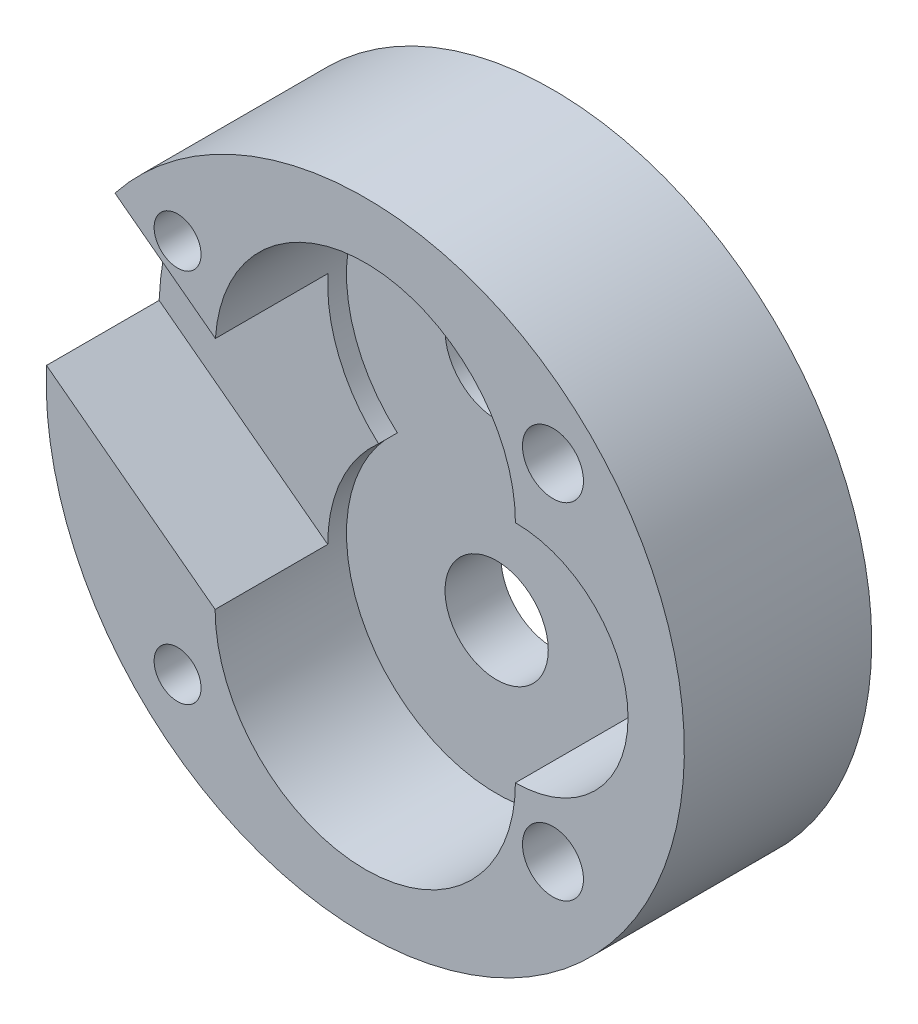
ISO-10303-21;
HEADER;
FILE_DESCRIPTION(('STEP AP214'),'2;1');
FILE_NAME('part.step','',(''),(''),'','','');
FILE_SCHEMA(('AUTOMOTIVE_DESIGN { 1 0 10303 214 1 1 1 1 }'));
ENDSEC;
DATA;
#1=APPLICATION_CONTEXT('core data for automotive mechanical design processes');
#2=APPLICATION_PROTOCOL_DEFINITION('international standard','automotive_design',2000,#1);
#3=PRODUCT_CONTEXT('',#1,'mechanical');
#4=PRODUCT('Part','Part','',(#3));
#5=PRODUCT_RELATED_PRODUCT_CATEGORY('part','',(#4));
#6=PRODUCT_DEFINITION_FORMATION('','',#4);
#7=PRODUCT_DEFINITION_CONTEXT('part definition',#1,'design');
#8=PRODUCT_DEFINITION('design','',#6,#7);
#9=PRODUCT_DEFINITION_SHAPE('','',#8);
#10=(LENGTH_UNIT() NAMED_UNIT(*) SI_UNIT(.MILLI.,.METRE.));
#11=(NAMED_UNIT(*) PLANE_ANGLE_UNIT() SI_UNIT($,.RADIAN.));
#12=(NAMED_UNIT(*) SI_UNIT($,.STERADIAN.) SOLID_ANGLE_UNIT());
#13=UNCERTAINTY_MEASURE_WITH_UNIT(LENGTH_MEASURE(1.E-05),#10,'distance_accuracy_value','');
#14=(GEOMETRIC_REPRESENTATION_CONTEXT(3) GLOBAL_UNCERTAINTY_ASSIGNED_CONTEXT((#13)) GLOBAL_UNIT_ASSIGNED_CONTEXT((#10,
#11,#12)) REPRESENTATION_CONTEXT('',''));
#15=CARTESIAN_POINT('',(0.,0.,0.));
#16=DIRECTION('',(0.,0.,1.));
#17=DIRECTION('',(1.,0.,0.));
#18=AXIS2_PLACEMENT_3D('',#15,#16,#17);
#19=CARTESIAN_POINT('',(0.,0.,31.6992));
#20=DIRECTION('',(0.,0.,-1.));
#21=DIRECTION('',(-1.,0.,0.));
#22=AXIS2_PLACEMENT_3D('',#19,#20,#21);
#23=CYLINDRICAL_SURFACE('',#22,53.975);
#24=CARTESIAN_POINT('',(0.,0.,12.6492));
#25=DIRECTION('',(0.,0.,1.));
#26=DIRECTION('',(1.,0.,0.));
#27=AXIS2_PLACEMENT_3D('',#24,#25,#26);
#28=CIRCLE('',#27,53.975);
#29=CARTESIAN_POINT('',(-53.9197666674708,2.44118568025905,12.6492));
#30=VERTEX_POINT('',#29);
#31=CARTESIAN_POINT('',(-42.3425886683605,33.4724634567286,12.6492));
#32=VERTEX_POINT('',#31);
#33=EDGE_CURVE('E149',#30,#32,#28,.F.);
#34=ORIENTED_EDGE('',*,*,#33,.T.);
#35=DIRECTION('',(0.,0.,1.));
#36=VECTOR('',#35,1.);
#37=CARTESIAN_POINT('',(-42.3425886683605,33.4724634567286,-51.6660204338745));
#38=LINE('',#37,#36);
#39=CARTESIAN_POINT('',(-42.3425886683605,33.4724634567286,31.6992));
#40=VERTEX_POINT('',#39);
#41=EDGE_CURVE('E119',#32,#40,#38,.T.);
#42=ORIENTED_EDGE('',*,*,#41,.T.);
#43=CARTESIAN_POINT('',(0.,0.,31.6992));
#44=DIRECTION('',(0.,0.,1.));
#45=DIRECTION('',(1.,0.,0.));
#46=AXIS2_PLACEMENT_3D('',#43,#44,#45);
#47=CIRCLE('',#46,53.975);
#48=CARTESIAN_POINT('',(-53.9197666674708,2.44118568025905,31.6992));
#49=VERTEX_POINT('',#48);
#50=EDGE_CURVE('E111',#49,#40,#47,.T.);
#51=ORIENTED_EDGE('',*,*,#50,.F.);
#52=DIRECTION('',(0.,0.,1.));
#53=VECTOR('',#52,1.);
#54=CARTESIAN_POINT('',(-53.9197666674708,2.44118568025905,-51.6660204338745));
#55=LINE('',#54,#53);
#56=EDGE_CURVE('E93',#30,#49,#55,.T.);
#57=ORIENTED_EDGE('',*,*,#56,.F.);
#58=EDGE_LOOP('',(#34,#42,#51,#57));
#59=FACE_BOUND('',#58,.T.);
#60=CARTESIAN_POINT('',(0.,0.,0.));
#61=DIRECTION('',(0.,0.,1.));
#62=DIRECTION('',(1.,0.,0.));
#63=AXIS2_PLACEMENT_3D('',#60,#61,#62);
#64=CIRCLE('',#63,53.975);
#65=CARTESIAN_POINT('',(53.975,0.,0.));
#66=VERTEX_POINT('',#65);
#67=EDGE_CURVE('E120',#66,#66,#64,.T.);
#68=ORIENTED_EDGE('',*,*,#67,.T.);
#69=EDGE_LOOP('',(#68));
#70=FACE_BOUND('',#69,.T.);
#71=ADVANCED_FACE('F28',(#59,#70),#23,.T.);
#72=CARTESIAN_POINT('',(0.,0.,31.6992));
#73=DIRECTION('',(0.,0.,1.));
#74=DIRECTION('',(1.,0.,0.));
#75=AXIS2_PLACEMENT_3D('',#72,#73,#74);
#76=PLANE('',#75);
#77=CARTESIAN_POINT('',(-31.75,-31.75,31.6992));
#78=DIRECTION('',(0.,0.,1.));
#79=DIRECTION('',(1.,0.,0.));
#80=AXIS2_PLACEMENT_3D('',#77,#78,#79);
#81=CIRCLE('',#80,3.96875);
#82=CARTESIAN_POINT('',(-27.78125,-31.75,31.6992));
#83=VERTEX_POINT('',#82);
#84=EDGE_CURVE('E194',#83,#83,#81,.T.);
#85=ORIENTED_EDGE('',*,*,#84,.F.);
#86=EDGE_LOOP('',(#85));
#87=FACE_BOUND('',#86,.T.);
#88=CARTESIAN_POINT('',(-31.75,31.75,31.6992));
#89=DIRECTION('',(0.,0.,1.));
#90=DIRECTION('',(1.,0.,0.));
#91=AXIS2_PLACEMENT_3D('',#88,#89,#90);
#92=CIRCLE('',#91,3.96875);
#93=CARTESIAN_POINT('',(-27.78125,31.75,31.6992));
#94=VERTEX_POINT('',#93);
#95=EDGE_CURVE('E188',#94,#94,#92,.T.);
#96=ORIENTED_EDGE('',*,*,#95,.F.);
#97=EDGE_LOOP('',(#96));
#98=FACE_BOUND('',#97,.T.);
#99=CARTESIAN_POINT('',(31.75,-27.430575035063,31.6992));
#100=DIRECTION('',(0.,0.,1.));
#101=DIRECTION('',(1.,0.,0.));
#102=AXIS2_PLACEMENT_3D('',#99,#100,#101);
#103=CIRCLE('',#102,5.159375);
#104=CARTESIAN_POINT('',(36.909375,-27.430575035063,31.6992));
#105=VERTEX_POINT('',#104);
#106=EDGE_CURVE('E182',#105,#105,#103,.T.);
#107=ORIENTED_EDGE('',*,*,#106,.F.);
#108=EDGE_LOOP('',(#107));
#109=FACE_BOUND('',#108,.T.);
#110=CARTESIAN_POINT('',(31.75,30.9138226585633,31.6992));
#111=DIRECTION('',(0.,0.,1.));
#112=DIRECTION('',(1.,0.,0.));
#113=AXIS2_PLACEMENT_3D('',#110,#111,#112);
#114=CIRCLE('',#113,5.159375);
#115=CARTESIAN_POINT('',(36.909375,30.9138226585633,31.6992));
#116=VERTEX_POINT('',#115);
#117=EDGE_CURVE('E176',#116,#116,#114,.T.);
#118=ORIENTED_EDGE('',*,*,#117,.F.);
#119=EDGE_LOOP('',(#118));
#120=FACE_BOUND('',#119,.T.);
#121=DIRECTION('',(-0.798635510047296,0.601815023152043,0.));
#122=VECTOR('',#121,1.);
#123=CARTESIAN_POINT('',(-42.3425886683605,33.4724634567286,31.6992));
#124=LINE('',#123,#122);
#125=CARTESIAN_POINT('',(-25.3485090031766,20.6665058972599,31.6992));
#126=VERTEX_POINT('',#125);
#127=EDGE_CURVE('E104',#126,#40,#124,.T.);
#128=ORIENTED_EDGE('',*,*,#127,.F.);
#129=CARTESIAN_POINT('',(0.,19.05,31.6992));
#130=DIRECTION('',(0.,0.,1.));
#131=DIRECTION('',(-1.,0.,0.));
#132=AXIS2_PLACEMENT_3D('',#129,#130,#131);
#133=CIRCLE('',#132,25.4);
#134=CARTESIAN_POINT('',(25.4,19.05,31.6992));
#135=VERTEX_POINT('',#134);
#136=EDGE_CURVE('E137',#135,#126,#133,.T.);
#137=ORIENTED_EDGE('',*,*,#136,.F.);
#138=CARTESIAN_POINT('',(25.4,0.,31.6992));
#139=DIRECTION('',(0.,0.,1.));
#140=DIRECTION('',(1.,0.,0.));
#141=AXIS2_PLACEMENT_3D('',#138,#139,#140);
#142=CIRCLE('',#141,19.05);
#143=CARTESIAN_POINT('',(25.4,-19.05,31.6992));
#144=VERTEX_POINT('',#143);
#145=EDGE_CURVE('E147',#144,#135,#142,.T.);
#146=ORIENTED_EDGE('',*,*,#145,.F.);
#147=CARTESIAN_POINT('',(0.,-19.05,31.6992));
#148=DIRECTION('',(0.,0.,1.));
#149=DIRECTION('',(1.,0.,0.));
#150=AXIS2_PLACEMENT_3D('',#147,#148,#149);
#151=CIRCLE('',#150,25.4);
#152=CARTESIAN_POINT('',(-25.4,-19.05,31.6992));
#153=VERTEX_POINT('',#152);
#154=EDGE_CURVE('E113',#153,#144,#151,.T.);
#155=ORIENTED_EDGE('',*,*,#154,.F.);
#156=DIRECTION('',(0.798635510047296,-0.601815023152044,0.));
#157=VECTOR('',#156,1.);
#158=CARTESIAN_POINT('',(-53.9197666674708,2.44118568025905,31.6992));
#159=LINE('',#158,#157);
#160=EDGE_CURVE('E96',#49,#153,#159,.T.);
#161=ORIENTED_EDGE('',*,*,#160,.F.);
#162=ORIENTED_EDGE('',*,*,#50,.T.);
#163=EDGE_LOOP('',(#128,#137,#146,#155,#161,#162));
#164=FACE_BOUND('',#163,.T.);
#165=ADVANCED_FACE('F110',(#87,#98,#109,#120,#164),#76,.T.);
#166=CARTESIAN_POINT('',(0.,0.,0.));
#167=DIRECTION('',(0.,0.,1.));
#168=DIRECTION('',(1.,0.,0.));
#169=AXIS2_PLACEMENT_3D('',#166,#167,#168);
#170=PLANE('',#169);
#171=CARTESIAN_POINT('',(-31.75,-31.75,0.));
#172=DIRECTION('',(0.,0.,1.));
#173=DIRECTION('',(1.,0.,0.));
#174=AXIS2_PLACEMENT_3D('',#171,#172,#173);
#175=CIRCLE('',#174,3.96875);
#176=CARTESIAN_POINT('',(-27.78125,-31.75,0.));
#177=VERTEX_POINT('',#176);
#178=EDGE_CURVE('E191',#177,#177,#175,.T.);
#179=ORIENTED_EDGE('',*,*,#178,.T.);
#180=EDGE_LOOP('',(#179));
#181=FACE_BOUND('',#180,.T.);
#182=CARTESIAN_POINT('',(-31.75,31.75,0.));
#183=DIRECTION('',(0.,0.,1.));
#184=DIRECTION('',(1.,0.,0.));
#185=AXIS2_PLACEMENT_3D('',#182,#183,#184);
#186=CIRCLE('',#185,3.96875);
#187=CARTESIAN_POINT('',(-27.78125,31.75,0.));
#188=VERTEX_POINT('',#187);
#189=EDGE_CURVE('E185',#188,#188,#186,.T.);
#190=ORIENTED_EDGE('',*,*,#189,.T.);
#191=EDGE_LOOP('',(#190));
#192=FACE_BOUND('',#191,.T.);
#193=CARTESIAN_POINT('',(31.75,-27.430575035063,0.));
#194=DIRECTION('',(0.,0.,1.));
#195=DIRECTION('',(1.,0.,0.));
#196=AXIS2_PLACEMENT_3D('',#193,#194,#195);
#197=CIRCLE('',#196,5.159375);
#198=CARTESIAN_POINT('',(36.909375,-27.430575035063,0.));
#199=VERTEX_POINT('',#198);
#200=EDGE_CURVE('E179',#199,#199,#197,.T.);
#201=ORIENTED_EDGE('',*,*,#200,.T.);
#202=EDGE_LOOP('',(#201));
#203=FACE_BOUND('',#202,.T.);
#204=CARTESIAN_POINT('',(31.75,30.9138226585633,0.));
#205=DIRECTION('',(0.,0.,1.));
#206=DIRECTION('',(1.,0.,0.));
#207=AXIS2_PLACEMENT_3D('',#204,#205,#206);
#208=CIRCLE('',#207,5.159375);
#209=CARTESIAN_POINT('',(36.909375,30.9138226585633,0.));
#210=VERTEX_POINT('',#209);
#211=EDGE_CURVE('E173',#210,#210,#208,.T.);
#212=ORIENTED_EDGE('',*,*,#211,.T.);
#213=EDGE_LOOP('',(#212));
#214=FACE_BOUND('',#213,.T.);
#215=CARTESIAN_POINT('',(0.,19.05,0.));
#216=DIRECTION('',(0.,0.,1.));
#217=DIRECTION('',(1.,0.,0.));
#218=AXIS2_PLACEMENT_3D('',#215,#216,#217);
#219=CIRCLE('',#218,8.73125);
#220=CARTESIAN_POINT('',(8.73125,19.05,0.));
#221=VERTEX_POINT('',#220);
#222=EDGE_CURVE('E167',#221,#221,#219,.T.);
#223=ORIENTED_EDGE('',*,*,#222,.T.);
#224=EDGE_LOOP('',(#223));
#225=FACE_BOUND('',#224,.T.);
#226=CARTESIAN_POINT('',(0.,-19.05,0.));
#227=DIRECTION('',(0.,0.,1.));
#228=DIRECTION('',(1.,0.,0.));
#229=AXIS2_PLACEMENT_3D('',#226,#227,#228);
#230=CIRCLE('',#229,8.73125);
#231=CARTESIAN_POINT('',(8.73125,-19.05,0.));
#232=VERTEX_POINT('',#231);
#233=EDGE_CURVE('E114',#232,#232,#230,.T.);
#234=ORIENTED_EDGE('',*,*,#233,.T.);
#235=EDGE_LOOP('',(#234));
#236=FACE_BOUND('',#235,.T.);
#237=ORIENTED_EDGE('',*,*,#67,.F.);
#238=EDGE_LOOP('',(#237));
#239=FACE_BOUND('',#238,.T.);
#240=ADVANCED_FACE('F202',(#181,#192,#203,#214,#225,#236,#239),#170,.F.);
#241=CARTESIAN_POINT('',(0.,-19.05,9.4742));
#242=DIRECTION('',(0.,0.,1.));
#243=DIRECTION('',(1.,0.,0.));
#244=AXIS2_PLACEMENT_3D('',#241,#242,#243);
#245=CYLINDRICAL_SURFACE('',#244,25.4);
#246=CARTESIAN_POINT('',(0.,-19.05,12.6492));
#247=DIRECTION('',(0.,0.,1.));
#248=DIRECTION('',(1.,0.,0.));
#249=AXIS2_PLACEMENT_3D('',#246,#247,#248);
#250=CIRCLE('',#249,25.4);
#251=CARTESIAN_POINT('',(-16.8005208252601,0.,12.6492));
#252=VERTEX_POINT('',#251);
#253=CARTESIAN_POINT('',(-25.4,-19.05,12.6492));
#254=VERTEX_POINT('',#253);
#255=EDGE_CURVE('E42',#252,#254,#250,.T.);
#256=ORIENTED_EDGE('',*,*,#255,.T.);
#257=DIRECTION('',(0.,0.,1.));
#258=VECTOR('',#257,1.);
#259=CARTESIAN_POINT('',(-25.4,-19.05,-51.6660204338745));
#260=LINE('',#259,#258);
#261=EDGE_CURVE('E103',#254,#153,#260,.T.);
#262=ORIENTED_EDGE('',*,*,#261,.T.);
#263=ORIENTED_EDGE('',*,*,#154,.T.);
#264=DIRECTION('',(0.,0.,1.));
#265=VECTOR('',#264,1.);
#266=CARTESIAN_POINT('',(25.4,-19.05,22.1742));
#267=LINE('',#266,#265);
#268=CARTESIAN_POINT('',(25.4,-19.05,12.6492));
#269=VERTEX_POINT('',#268);
#270=EDGE_CURVE('E141',#144,#269,#267,.F.);
#271=ORIENTED_EDGE('',*,*,#270,.T.);
#272=CARTESIAN_POINT('',(0.,-19.05,12.6492));
#273=DIRECTION('',(0.,0.,1.));
#274=DIRECTION('',(1.,0.,0.));
#275=AXIS2_PLACEMENT_3D('',#272,#273,#274);
#276=CIRCLE('',#275,25.4);
#277=CARTESIAN_POINT('',(16.8005208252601,0.,12.6492));
#278=VERTEX_POINT('',#277);
#279=EDGE_CURVE('E144',#278,#269,#276,.F.);
#280=ORIENTED_EDGE('',*,*,#279,.F.);
#281=DIRECTION('',(0.,0.,1.));
#282=VECTOR('',#281,1.);
#283=CARTESIAN_POINT('',(16.8005208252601,0.,9.4742));
#284=LINE('',#283,#282);
#285=CARTESIAN_POINT('',(16.8005208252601,0.,9.4742));
#286=VERTEX_POINT('',#285);
#287=EDGE_CURVE('E126',#286,#278,#284,.T.);
#288=ORIENTED_EDGE('',*,*,#287,.F.);
#289=CARTESIAN_POINT('',(0.,-19.05,9.4742));
#290=DIRECTION('',(0.,0.,1.));
#291=DIRECTION('',(1.,0.,0.));
#292=AXIS2_PLACEMENT_3D('',#289,#290,#291);
#293=CIRCLE('',#292,25.4);
#294=CARTESIAN_POINT('',(-16.8005208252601,0.,9.4742));
#295=VERTEX_POINT('',#294);
#296=EDGE_CURVE('E134',#295,#286,#293,.T.);
#297=ORIENTED_EDGE('',*,*,#296,.F.);
#298=DIRECTION('',(0.,0.,1.));
#299=VECTOR('',#298,1.);
#300=CARTESIAN_POINT('',(-16.8005208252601,0.,9.4742));
#301=LINE('',#300,#299);
#302=EDGE_CURVE('E123',#295,#252,#301,.T.);
#303=ORIENTED_EDGE('',*,*,#302,.T.);
#304=EDGE_LOOP('',(#256,#262,#263,#271,#280,#288,#297,#303));
#305=FACE_BOUND('',#304,.T.);
#306=ADVANCED_FACE('F238',(#305),#245,.F.);
#307=CARTESIAN_POINT('',(0.,19.05,9.4742));
#308=DIRECTION('',(0.,0.,1.));
#309=DIRECTION('',(1.,0.,0.));
#310=AXIS2_PLACEMENT_3D('',#307,#308,#309);
#311=CYLINDRICAL_SURFACE('',#310,25.4);
#312=ORIENTED_EDGE('',*,*,#136,.T.);
#313=DIRECTION('',(0.,0.,1.));
#314=VECTOR('',#313,1.);
#315=CARTESIAN_POINT('',(-25.3485090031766,20.6665058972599,-51.6660204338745));
#316=LINE('',#315,#314);
#317=CARTESIAN_POINT('',(-25.3485090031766,20.6665058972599,12.6492));
#318=VERTEX_POINT('',#317);
#319=EDGE_CURVE('E152',#318,#126,#316,.T.);
#320=ORIENTED_EDGE('',*,*,#319,.F.);
#321=CARTESIAN_POINT('',(0.,19.05,12.6492));
#322=DIRECTION('',(0.,0.,1.));
#323=DIRECTION('',(1.,0.,0.));
#324=AXIS2_PLACEMENT_3D('',#321,#322,#323);
#325=CIRCLE('',#324,25.4);
#326=EDGE_CURVE('E159',#318,#252,#325,.T.);
#327=ORIENTED_EDGE('',*,*,#326,.T.);
#328=ORIENTED_EDGE('',*,*,#302,.F.);
#329=CARTESIAN_POINT('',(0.,19.05,9.4742));
#330=DIRECTION('',(0.,0.,1.));
#331=DIRECTION('',(-1.,0.,0.));
#332=AXIS2_PLACEMENT_3D('',#329,#330,#331);
#333=CIRCLE('',#332,25.4);
#334=EDGE_CURVE('E129',#286,#295,#333,.T.);
#335=ORIENTED_EDGE('',*,*,#334,.F.);
#336=ORIENTED_EDGE('',*,*,#287,.T.);
#337=CARTESIAN_POINT('',(0.,19.05,12.6492));
#338=DIRECTION('',(0.,0.,1.));
#339=DIRECTION('',(1.,0.,0.));
#340=AXIS2_PLACEMENT_3D('',#337,#338,#339);
#341=CIRCLE('',#340,25.4);
#342=CARTESIAN_POINT('',(25.4,19.05,12.6492));
#343=VERTEX_POINT('',#342);
#344=EDGE_CURVE('E35',#343,#278,#341,.F.);
#345=ORIENTED_EDGE('',*,*,#344,.F.);
#346=DIRECTION('',(0.,0.,1.));
#347=VECTOR('',#346,1.);
#348=CARTESIAN_POINT('',(25.4,19.05,22.1742));
#349=LINE('',#348,#347);
#350=EDGE_CURVE('E11',#343,#135,#349,.T.);
#351=ORIENTED_EDGE('',*,*,#350,.T.);
#352=EDGE_LOOP('',(#312,#320,#327,#328,#335,#336,#345,#351));
#353=FACE_BOUND('',#352,.T.);
#354=ADVANCED_FACE('F242',(#353),#311,.F.);
#355=CARTESIAN_POINT('',(0.,0.,9.4742));
#356=DIRECTION('',(0.,0.,1.));
#357=DIRECTION('',(1.,0.,0.));
#358=AXIS2_PLACEMENT_3D('',#355,#356,#357);
#359=PLANE('',#358);
#360=CARTESIAN_POINT('',(0.,19.05,9.4742));
#361=DIRECTION('',(0.,0.,1.));
#362=DIRECTION('',(1.,0.,0.));
#363=AXIS2_PLACEMENT_3D('',#360,#361,#362);
#364=CIRCLE('',#363,8.73125);
#365=CARTESIAN_POINT('',(8.73125,19.05,9.4742));
#366=VERTEX_POINT('',#365);
#367=EDGE_CURVE('E170',#366,#366,#364,.T.);
#368=ORIENTED_EDGE('',*,*,#367,.F.);
#369=EDGE_LOOP('',(#368));
#370=FACE_BOUND('',#369,.T.);
#371=CARTESIAN_POINT('',(0.,-19.05,9.4742));
#372=DIRECTION('',(0.,0.,1.));
#373=DIRECTION('',(1.,0.,0.));
#374=AXIS2_PLACEMENT_3D('',#371,#372,#373);
#375=CIRCLE('',#374,8.73125);
#376=CARTESIAN_POINT('',(8.73125,-19.05,9.4742));
#377=VERTEX_POINT('',#376);
#378=EDGE_CURVE('E164',#377,#377,#375,.T.);
#379=ORIENTED_EDGE('',*,*,#378,.F.);
#380=EDGE_LOOP('',(#379));
#381=FACE_BOUND('',#380,.T.);
#382=ORIENTED_EDGE('',*,*,#296,.T.);
#383=ORIENTED_EDGE('',*,*,#334,.T.);
#384=EDGE_LOOP('',(#382,#383));
#385=FACE_BOUND('',#384,.T.);
#386=ADVANCED_FACE('F251',(#370,#381,#385),#359,.T.);
#387=CARTESIAN_POINT('',(25.4,0.,12.6492));
#388=DIRECTION('',(0.,0.,1.));
#389=DIRECTION('',(1.,0.,0.));
#390=AXIS2_PLACEMENT_3D('',#387,#388,#389);
#391=CYLINDRICAL_SURFACE('',#390,19.05);
#392=ORIENTED_EDGE('',*,*,#145,.T.);
#393=ORIENTED_EDGE('',*,*,#350,.F.);
#394=CARTESIAN_POINT('',(25.4,0.,12.6492));
#395=DIRECTION('',(0.,0.,1.));
#396=DIRECTION('',(1.,0.,0.));
#397=AXIS2_PLACEMENT_3D('',#394,#395,#396);
#398=CIRCLE('',#397,19.05);
#399=EDGE_CURVE('E50',#269,#343,#398,.T.);
#400=ORIENTED_EDGE('',*,*,#399,.F.);
#401=ORIENTED_EDGE('',*,*,#270,.F.);
#402=EDGE_LOOP('',(#392,#393,#400,#401));
#403=FACE_BOUND('',#402,.T.);
#404=ADVANCED_FACE('F281',(#403),#391,.F.);
#405=CARTESIAN_POINT('',(25.4,0.,12.6492));
#406=DIRECTION('',(0.,0.,1.));
#407=DIRECTION('',(1.,0.,0.));
#408=AXIS2_PLACEMENT_3D('',#405,#406,#407);
#409=PLANE('',#408);
#410=ORIENTED_EDGE('',*,*,#279,.T.);
#411=ORIENTED_EDGE('',*,*,#399,.T.);
#412=ORIENTED_EDGE('',*,*,#344,.T.);
#413=EDGE_LOOP('',(#410,#411,#412));
#414=FACE_BOUND('',#413,.T.);
#415=ADVANCED_FACE('F234',(#414),#409,.T.);
#416=CARTESIAN_POINT('',(-42.3425886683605,33.4724634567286,-51.6660204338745));
#417=DIRECTION('',(0.601815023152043,0.798635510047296,0.));
#418=DIRECTION('',(-0.798635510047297,0.601815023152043,0.));
#419=AXIS2_PLACEMENT_3D('',#416,#417,#418);
#420=PLANE('',#419);
#421=DIRECTION('',(0.798635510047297,-0.601815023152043,0.));
#422=VECTOR('',#421,1.);
#423=CARTESIAN_POINT('',(-42.3425886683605,33.4724634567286,12.6492));
#424=LINE('',#423,#422);
#425=EDGE_CURVE('E157',#32,#318,#424,.T.);
#426=ORIENTED_EDGE('',*,*,#425,.T.);
#427=ORIENTED_EDGE('',*,*,#319,.T.);
#428=ORIENTED_EDGE('',*,*,#127,.T.);
#429=ORIENTED_EDGE('',*,*,#41,.F.);
#430=EDGE_LOOP('',(#426,#427,#428,#429));
#431=FACE_BOUND('',#430,.T.);
#432=ADVANCED_FACE('F257',(#431),#420,.F.);
#433=CARTESIAN_POINT('',(-53.9197666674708,2.44118568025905,-51.6660204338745));
#434=DIRECTION('',(-0.601815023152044,-0.798635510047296,0.));
#435=DIRECTION('',(0.798635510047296,-0.601815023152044,0.));
#436=AXIS2_PLACEMENT_3D('',#433,#434,#435);
#437=PLANE('',#436);
#438=DIRECTION('',(-0.798635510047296,0.601815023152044,0.));
#439=VECTOR('',#438,1.);
#440=CARTESIAN_POINT('',(-53.9197666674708,2.44118568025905,12.6492));
#441=LINE('',#440,#439);
#442=EDGE_CURVE('E98',#254,#30,#441,.T.);
#443=ORIENTED_EDGE('',*,*,#442,.T.);
#444=ORIENTED_EDGE('',*,*,#56,.T.);
#445=ORIENTED_EDGE('',*,*,#160,.T.);
#446=ORIENTED_EDGE('',*,*,#261,.F.);
#447=EDGE_LOOP('',(#443,#444,#445,#446));
#448=FACE_BOUND('',#447,.T.);
#449=ADVANCED_FACE('F95',(#448),#437,.F.);
#450=CARTESIAN_POINT('',(25.4,0.,12.6492));
#451=DIRECTION('',(0.,0.,1.));
#452=DIRECTION('',(1.,0.,0.));
#453=AXIS2_PLACEMENT_3D('',#450,#451,#452);
#454=PLANE('',#453);
#455=ORIENTED_EDGE('',*,*,#33,.F.);
#456=ORIENTED_EDGE('',*,*,#442,.F.);
#457=ORIENTED_EDGE('',*,*,#255,.F.);
#458=ORIENTED_EDGE('',*,*,#326,.F.);
#459=ORIENTED_EDGE('',*,*,#425,.F.);
#460=EDGE_LOOP('',(#455,#456,#457,#458,#459));
#461=FACE_BOUND('',#460,.T.);
#462=ADVANCED_FACE('F268',(#461),#454,.T.);
#463=CARTESIAN_POINT('',(0.,-19.05,-12.7508));
#464=DIRECTION('',(0.,0.,1.));
#465=DIRECTION('',(1.,0.,0.));
#466=AXIS2_PLACEMENT_3D('',#463,#464,#465);
#467=CYLINDRICAL_SURFACE('',#466,8.73125);
#468=ORIENTED_EDGE('',*,*,#378,.T.);
#469=EDGE_LOOP('',(#468));
#470=FACE_BOUND('',#469,.T.);
#471=ORIENTED_EDGE('',*,*,#233,.F.);
#472=EDGE_LOOP('',(#471));
#473=FACE_BOUND('',#472,.T.);
#474=ADVANCED_FACE('F222',(#470,#473),#467,.F.);
#475=CARTESIAN_POINT('',(0.,19.05,-12.7508));
#476=DIRECTION('',(0.,0.,1.));
#477=DIRECTION('',(1.,0.,0.));
#478=AXIS2_PLACEMENT_3D('',#475,#476,#477);
#479=CYLINDRICAL_SURFACE('',#478,8.73125);
#480=ORIENTED_EDGE('',*,*,#367,.T.);
#481=EDGE_LOOP('',(#480));
#482=FACE_BOUND('',#481,.T.);
#483=ORIENTED_EDGE('',*,*,#222,.F.);
#484=EDGE_LOOP('',(#483));
#485=FACE_BOUND('',#484,.T.);
#486=ADVANCED_FACE('F212',(#482,#485),#479,.F.);
#487=CARTESIAN_POINT('',(31.75,30.9138226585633,0.));
#488=DIRECTION('',(0.,0.,1.));
#489=DIRECTION('',(1.,0.,0.));
#490=AXIS2_PLACEMENT_3D('',#487,#488,#489);
#491=CYLINDRICAL_SURFACE('',#490,5.159375);
#492=ORIENTED_EDGE('',*,*,#211,.F.);
#493=EDGE_LOOP('',(#492));
#494=FACE_BOUND('',#493,.T.);
#495=ORIENTED_EDGE('',*,*,#117,.T.);
#496=EDGE_LOOP('',(#495));
#497=FACE_BOUND('',#496,.T.);
#498=ADVANCED_FACE('F209',(#494,#497),#491,.F.);
#499=CARTESIAN_POINT('',(31.75,-27.430575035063,0.));
#500=DIRECTION('',(0.,0.,1.));
#501=DIRECTION('',(1.,0.,0.));
#502=AXIS2_PLACEMENT_3D('',#499,#500,#501);
#503=CYLINDRICAL_SURFACE('',#502,5.159375);
#504=ORIENTED_EDGE('',*,*,#200,.F.);
#505=EDGE_LOOP('',(#504));
#506=FACE_BOUND('',#505,.T.);
#507=ORIENTED_EDGE('',*,*,#106,.T.);
#508=EDGE_LOOP('',(#507));
#509=FACE_BOUND('',#508,.T.);
#510=ADVANCED_FACE('F211',(#506,#509),#503,.F.);
#511=CARTESIAN_POINT('',(-31.75,31.75,0.));
#512=DIRECTION('',(0.,0.,1.));
#513=DIRECTION('',(1.,0.,0.));
#514=AXIS2_PLACEMENT_3D('',#511,#512,#513);
#515=CYLINDRICAL_SURFACE('',#514,3.96875);
#516=ORIENTED_EDGE('',*,*,#189,.F.);
#517=EDGE_LOOP('',(#516));
#518=FACE_BOUND('',#517,.T.);
#519=ORIENTED_EDGE('',*,*,#95,.T.);
#520=EDGE_LOOP('',(#519));
#521=FACE_BOUND('',#520,.T.);
#522=ADVANCED_FACE('F219',(#518,#521),#515,.F.);
#523=CARTESIAN_POINT('',(-31.75,-31.75,0.));
#524=DIRECTION('',(0.,0.,1.));
#525=DIRECTION('',(1.,0.,0.));
#526=AXIS2_PLACEMENT_3D('',#523,#524,#525);
#527=CYLINDRICAL_SURFACE('',#526,3.96875);
#528=ORIENTED_EDGE('',*,*,#178,.F.);
#529=EDGE_LOOP('',(#528));
#530=FACE_BOUND('',#529,.T.);
#531=ORIENTED_EDGE('',*,*,#84,.T.);
#532=EDGE_LOOP('',(#531));
#533=FACE_BOUND('',#532,.T.);
#534=ADVANCED_FACE('F198',(#530,#533),#527,.F.);
#535=CLOSED_SHELL('',(#71,#165,#240,#306,#354,#386,#404,#415,#432,#449,#462,#474,#486,#498,#510,
#522,#534));
#536=MANIFOLD_SOLID_BREP('B2',#535);
#537=ADVANCED_BREP_SHAPE_REPRESENTATION('',(#18,#536),#14);
#538=SHAPE_DEFINITION_REPRESENTATION(#9,#537);
ENDSEC;
END-ISO-10303-21;
